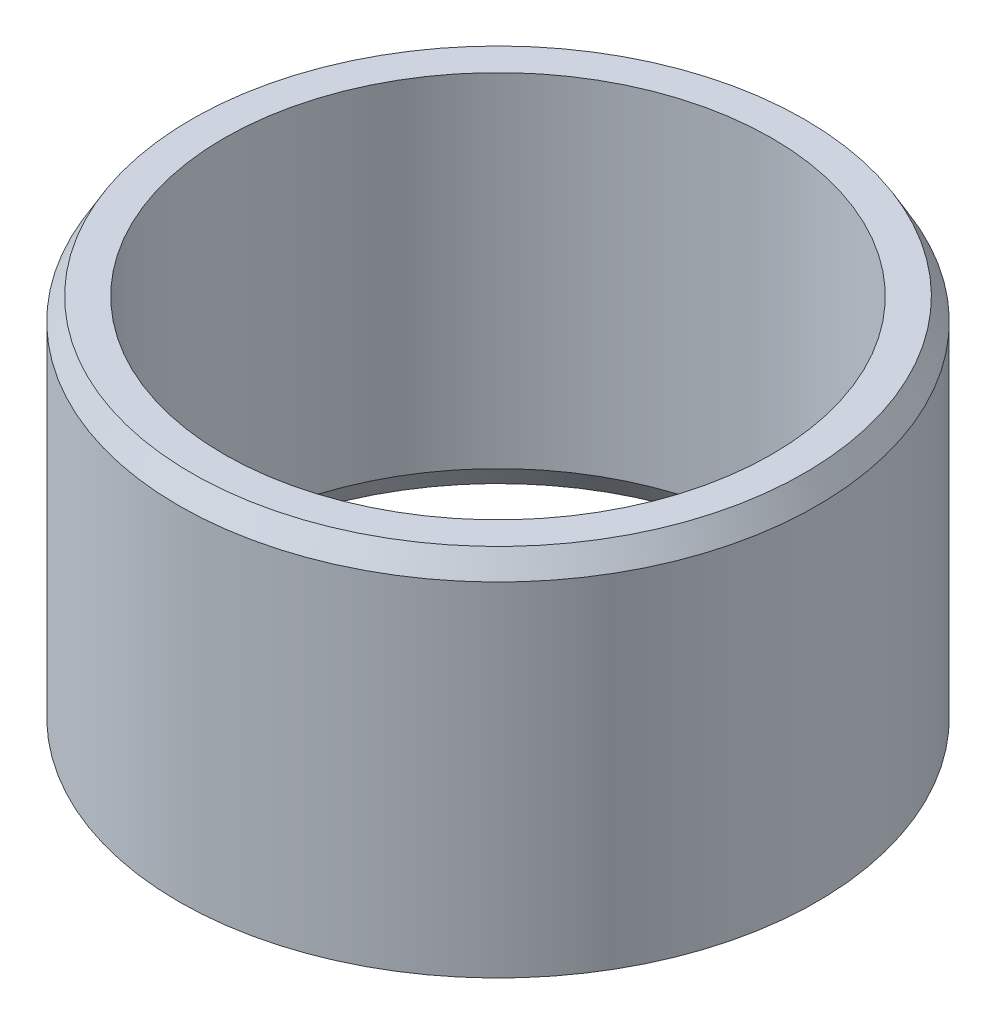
from build123d import *


with BuildPart() as part:
    # Sketch1 → IGLIDE (revolve)
    with BuildSketch(Plane.XY, mode=Mode.PRIVATE) as iglide_sk:
        Polygon((9.973830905, 0), (11.10869, 0), (11.10869, 11.938), (10.668749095, 12.7), (9.53389, 12.7), (9.53389, 0.762), align=None)
    revolve(iglide_sk.sketch.rotate(Axis((0, -4.48767573, 0), (0, 1, 0)), 90), axis=Axis((0, -4.48767573, 0), (0, 1, 0)))


solid = part.part
